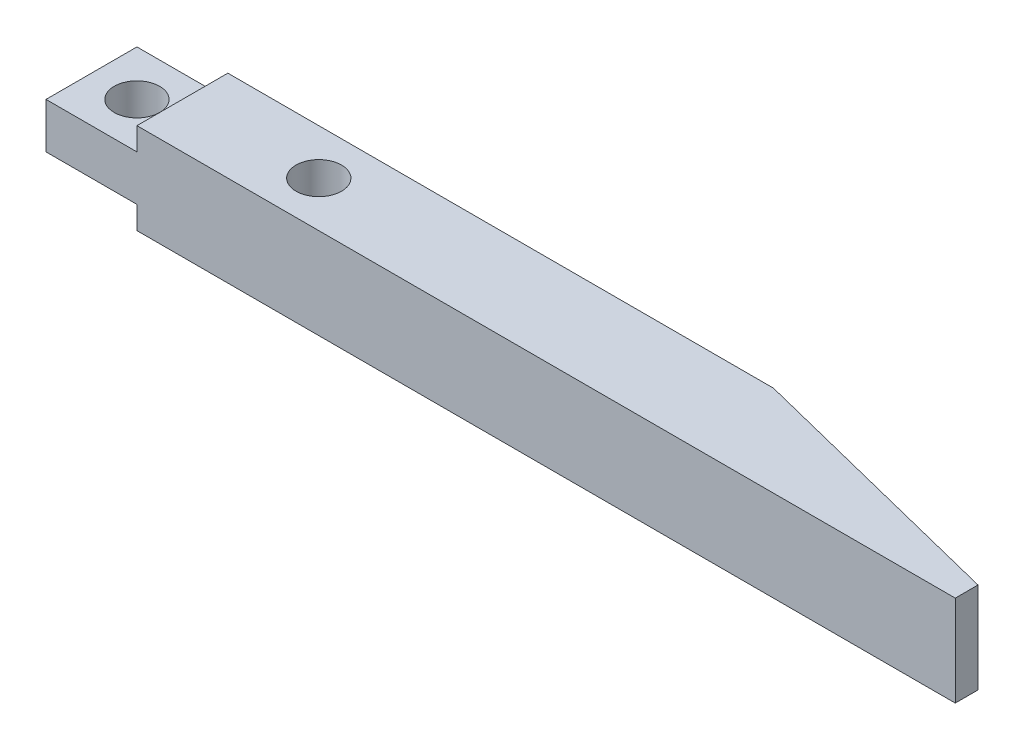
ISO-10303-21;
HEADER;
FILE_DESCRIPTION(('STEP AP214'),'2;1');
FILE_NAME('part.step','',(''),(''),'','','');
FILE_SCHEMA(('AUTOMOTIVE_DESIGN { 1 0 10303 214 1 1 1 1 }'));
ENDSEC;
DATA;
#1=APPLICATION_CONTEXT('core data for automotive mechanical design processes');
#2=APPLICATION_PROTOCOL_DEFINITION('international standard','automotive_design',2000,#1);
#3=PRODUCT_CONTEXT('',#1,'mechanical');
#4=PRODUCT('Part','Part','',(#3));
#5=PRODUCT_RELATED_PRODUCT_CATEGORY('part','',(#4));
#6=PRODUCT_DEFINITION_FORMATION('','',#4);
#7=PRODUCT_DEFINITION_CONTEXT('part definition',#1,'design');
#8=PRODUCT_DEFINITION('design','',#6,#7);
#9=PRODUCT_DEFINITION_SHAPE('','',#8);
#10=(LENGTH_UNIT() NAMED_UNIT(*) SI_UNIT(.MILLI.,.METRE.));
#11=(NAMED_UNIT(*) PLANE_ANGLE_UNIT() SI_UNIT($,.RADIAN.));
#12=(NAMED_UNIT(*) SI_UNIT($,.STERADIAN.) SOLID_ANGLE_UNIT());
#13=UNCERTAINTY_MEASURE_WITH_UNIT(LENGTH_MEASURE(1.E-05),#10,'distance_accuracy_value','');
#14=(GEOMETRIC_REPRESENTATION_CONTEXT(3) GLOBAL_UNCERTAINTY_ASSIGNED_CONTEXT((#13)) GLOBAL_UNIT_ASSIGNED_CONTEXT((#10,
#11,#12)) REPRESENTATION_CONTEXT('',''));
#15=CARTESIAN_POINT('',(0.,0.,0.));
#16=DIRECTION('',(0.,0.,1.));
#17=DIRECTION('',(1.,0.,0.));
#18=AXIS2_PLACEMENT_3D('',#15,#16,#17);
#19=CARTESIAN_POINT('',(0.,12.7,0.));
#20=DIRECTION('',(0.,1.,0.));
#21=DIRECTION('',(0.,0.,1.));
#22=AXIS2_PLACEMENT_3D('',#19,#20,#21);
#23=PLANE('',#22);
#24=DIRECTION('',(0.,0.,1.));
#25=VECTOR('',#24,1.);
#26=CARTESIAN_POINT('',(-19.05,12.7,-6.35));
#27=LINE('',#26,#25);
#28=CARTESIAN_POINT('',(-19.05,12.7,-6.35));
#29=VERTEX_POINT('',#28);
#30=CARTESIAN_POINT('',(-19.05,12.7,6.35));
#31=VERTEX_POINT('',#30);
#32=EDGE_CURVE('E156',#29,#31,#27,.T.);
#33=ORIENTED_EDGE('',*,*,#32,.T.);
#34=DIRECTION('',(1.,0.,0.));
#35=VECTOR('',#34,1.);
#36=CARTESIAN_POINT('',(-31.75,12.7,6.35));
#37=LINE('',#36,#35);
#38=CARTESIAN_POINT('',(95.25,12.7,6.35));
#39=VERTEX_POINT('',#38);
#40=EDGE_CURVE('E135',#31,#39,#37,.T.);
#41=ORIENTED_EDGE('',*,*,#40,.T.);
#42=DIRECTION('',(0.,0.,-1.));
#43=VECTOR('',#42,1.);
#44=CARTESIAN_POINT('',(95.25,12.7,6.35));
#45=LINE('',#44,#43);
#46=CARTESIAN_POINT('',(95.25,12.7,3.175));
#47=VERTEX_POINT('',#46);
#48=EDGE_CURVE('E138',#39,#47,#45,.T.);
#49=ORIENTED_EDGE('',*,*,#48,.T.);
#50=DIRECTION('',(-0.970142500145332,0.,-0.242535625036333));
#51=VECTOR('',#50,1.);
#52=CARTESIAN_POINT('',(95.25,12.7,3.175));
#53=LINE('',#52,#51);
#54=CARTESIAN_POINT('',(57.15,12.7,-6.35));
#55=VERTEX_POINT('',#54);
#56=EDGE_CURVE('E179',#47,#55,#53,.T.);
#57=ORIENTED_EDGE('',*,*,#56,.T.);
#58=DIRECTION('',(-1.,0.,0.));
#59=VECTOR('',#58,1.);
#60=CARTESIAN_POINT('',(57.15,12.7,-6.35));
#61=LINE('',#60,#59);
#62=EDGE_CURVE('E148',#55,#29,#61,.T.);
#63=ORIENTED_EDGE('',*,*,#62,.T.);
#64=EDGE_LOOP('',(#33,#41,#49,#57,#63));
#65=FACE_BOUND('',#64,.T.);
#66=CARTESIAN_POINT('',(0.,12.7,0.));
#67=DIRECTION('',(0.,1.,0.));
#68=DIRECTION('',(0.,0.,1.));
#69=AXIS2_PLACEMENT_3D('',#66,#67,#68);
#70=CIRCLE('',#69,3.175);
#71=CARTESIAN_POINT('',(0.,12.7,3.175));
#72=VERTEX_POINT('',#71);
#73=EDGE_CURVE('E160',#72,#72,#70,.T.);
#74=ORIENTED_EDGE('',*,*,#73,.F.);
#75=EDGE_LOOP('',(#74));
#76=FACE_BOUND('',#75,.T.);
#77=ADVANCED_FACE('F35',(#65,#76),#23,.T.);
#78=CARTESIAN_POINT('',(0.,0.,0.));
#79=DIRECTION('',(0.,1.,0.));
#80=DIRECTION('',(0.,0.,1.));
#81=AXIS2_PLACEMENT_3D('',#78,#79,#80);
#82=PLANE('',#81);
#83=DIRECTION('',(1.,0.,0.));
#84=VECTOR('',#83,1.);
#85=CARTESIAN_POINT('',(-1.01275936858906,0.,6.35));
#86=LINE('',#85,#84);
#87=CARTESIAN_POINT('',(-19.05,0.,6.35));
#88=VERTEX_POINT('',#87);
#89=CARTESIAN_POINT('',(95.25,0.,6.35));
#90=VERTEX_POINT('',#89);
#91=EDGE_CURVE('E128',#88,#90,#86,.T.);
#92=ORIENTED_EDGE('',*,*,#91,.F.);
#93=DIRECTION('',(0.,0.,1.));
#94=VECTOR('',#93,1.);
#95=CARTESIAN_POINT('',(-19.05,0.,-6.35));
#96=LINE('',#95,#94);
#97=CARTESIAN_POINT('',(-19.05,0.,-6.35));
#98=VERTEX_POINT('',#97);
#99=EDGE_CURVE('E111',#98,#88,#96,.T.);
#100=ORIENTED_EDGE('',*,*,#99,.F.);
#101=DIRECTION('',(-1.,0.,0.));
#102=VECTOR('',#101,1.);
#103=CARTESIAN_POINT('',(57.15,0.,-6.35));
#104=LINE('',#103,#102);
#105=CARTESIAN_POINT('',(57.15,0.,-6.35));
#106=VERTEX_POINT('',#105);
#107=EDGE_CURVE('E126',#106,#98,#104,.T.);
#108=ORIENTED_EDGE('',*,*,#107,.F.);
#109=DIRECTION('',(-0.970142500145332,0.,-0.242535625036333));
#110=VECTOR('',#109,1.);
#111=CARTESIAN_POINT('',(95.25,0.,3.175));
#112=LINE('',#111,#110);
#113=CARTESIAN_POINT('',(95.25,0.,3.175));
#114=VERTEX_POINT('',#113);
#115=EDGE_CURVE('E136',#114,#106,#112,.T.);
#116=ORIENTED_EDGE('',*,*,#115,.F.);
#117=DIRECTION('',(0.,0.,-1.));
#118=VECTOR('',#117,1.);
#119=CARTESIAN_POINT('',(95.25,0.,6.35));
#120=LINE('',#119,#118);
#121=EDGE_CURVE('E140',#90,#114,#120,.T.);
#122=ORIENTED_EDGE('',*,*,#121,.F.);
#123=EDGE_LOOP('',(#92,#100,#108,#116,#122));
#124=FACE_BOUND('',#123,.T.);
#125=CARTESIAN_POINT('',(0.,0.,0.));
#126=DIRECTION('',(0.,1.,0.));
#127=DIRECTION('',(0.,0.,1.));
#128=AXIS2_PLACEMENT_3D('',#125,#126,#127);
#129=CIRCLE('',#128,3.175);
#130=CARTESIAN_POINT('',(0.,0.,3.175));
#131=VERTEX_POINT('',#130);
#132=EDGE_CURVE('E155',#131,#131,#129,.T.);
#133=ORIENTED_EDGE('',*,*,#132,.T.);
#134=EDGE_LOOP('',(#133));
#135=FACE_BOUND('',#134,.T.);
#136=ADVANCED_FACE('F123',(#124,#135),#82,.F.);
#137=CARTESIAN_POINT('',(-1.01275936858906,12.7,6.35));
#138=DIRECTION('',(0.,0.,-1.));
#139=DIRECTION('',(-1.,0.,0.));
#140=AXIS2_PLACEMENT_3D('',#137,#138,#139);
#141=PLANE('',#140);
#142=DIRECTION('',(0.,-1.,0.));
#143=VECTOR('',#142,1.);
#144=CARTESIAN_POINT('',(-31.75,12.7,6.35));
#145=LINE('',#144,#143);
#146=CARTESIAN_POINT('',(-31.75,9.525,6.35));
#147=VERTEX_POINT('',#146);
#148=CARTESIAN_POINT('',(-31.75,3.175,6.35));
#149=VERTEX_POINT('',#148);
#150=EDGE_CURVE('E144',#147,#149,#145,.T.);
#151=ORIENTED_EDGE('',*,*,#150,.T.);
#152=DIRECTION('',(-1.,0.,0.));
#153=VECTOR('',#152,1.);
#154=CARTESIAN_POINT('',(-31.75,3.175,6.35));
#155=LINE('',#154,#153);
#156=CARTESIAN_POINT('',(-19.05,3.175,6.35));
#157=VERTEX_POINT('',#156);
#158=EDGE_CURVE('E52',#157,#149,#155,.T.);
#159=ORIENTED_EDGE('',*,*,#158,.F.);
#160=DIRECTION('',(0.,1.,0.));
#161=VECTOR('',#160,1.);
#162=CARTESIAN_POINT('',(-19.05,0.,6.35));
#163=LINE('',#162,#161);
#164=EDGE_CURVE('E193',#88,#157,#163,.T.);
#165=ORIENTED_EDGE('',*,*,#164,.F.);
#166=ORIENTED_EDGE('',*,*,#91,.T.);
#167=DIRECTION('',(0.,-1.,0.));
#168=VECTOR('',#167,1.);
#169=CARTESIAN_POINT('',(95.25,12.7,6.35));
#170=LINE('',#169,#168);
#171=EDGE_CURVE('E11',#39,#90,#170,.T.);
#172=ORIENTED_EDGE('',*,*,#171,.F.);
#173=ORIENTED_EDGE('',*,*,#40,.F.);
#174=DIRECTION('',(0.,1.,0.));
#175=VECTOR('',#174,1.);
#176=CARTESIAN_POINT('',(-19.05,12.7,6.35));
#177=LINE('',#176,#175);
#178=CARTESIAN_POINT('',(-19.05,9.525,6.35));
#179=VERTEX_POINT('',#178);
#180=EDGE_CURVE('E171',#179,#31,#177,.T.);
#181=ORIENTED_EDGE('',*,*,#180,.F.);
#182=DIRECTION('',(1.,0.,0.));
#183=VECTOR('',#182,1.);
#184=CARTESIAN_POINT('',(-31.75,9.525,6.35));
#185=LINE('',#184,#183);
#186=EDGE_CURVE('E203',#147,#179,#185,.T.);
#187=ORIENTED_EDGE('',*,*,#186,.F.);
#188=EDGE_LOOP('',(#151,#159,#165,#166,#172,#173,#181,#187));
#189=FACE_BOUND('',#188,.T.);
#190=ADVANCED_FACE('F37',(#189),#141,.F.);
#191=CARTESIAN_POINT('',(95.25,12.7,6.35));
#192=DIRECTION('',(-1.,0.,0.));
#193=DIRECTION('',(0.,0.,1.));
#194=AXIS2_PLACEMENT_3D('',#191,#192,#193);
#195=PLANE('',#194);
#196=ORIENTED_EDGE('',*,*,#121,.T.);
#197=DIRECTION('',(0.,-1.,0.));
#198=VECTOR('',#197,1.);
#199=CARTESIAN_POINT('',(95.25,12.7,3.175));
#200=LINE('',#199,#198);
#201=EDGE_CURVE('E44',#47,#114,#200,.T.);
#202=ORIENTED_EDGE('',*,*,#201,.F.);
#203=ORIENTED_EDGE('',*,*,#48,.F.);
#204=ORIENTED_EDGE('',*,*,#171,.T.);
#205=EDGE_LOOP('',(#196,#202,#203,#204));
#206=FACE_BOUND('',#205,.T.);
#207=ADVANCED_FACE('F184',(#206),#195,.F.);
#208=CARTESIAN_POINT('',(95.25,12.7,3.175));
#209=DIRECTION('',(-0.242535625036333,0.,0.970142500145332));
#210=DIRECTION('',(0.970142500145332,0.,0.242535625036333));
#211=AXIS2_PLACEMENT_3D('',#208,#209,#210);
#212=PLANE('',#211);
#213=ORIENTED_EDGE('',*,*,#115,.T.);
#214=DIRECTION('',(0.,-1.,0.));
#215=VECTOR('',#214,1.);
#216=CARTESIAN_POINT('',(57.15,12.7,-6.35));
#217=LINE('',#216,#215);
#218=EDGE_CURVE('E134',#55,#106,#217,.T.);
#219=ORIENTED_EDGE('',*,*,#218,.F.);
#220=ORIENTED_EDGE('',*,*,#56,.F.);
#221=ORIENTED_EDGE('',*,*,#201,.T.);
#222=EDGE_LOOP('',(#213,#219,#220,#221));
#223=FACE_BOUND('',#222,.T.);
#224=ADVANCED_FACE('F189',(#223),#212,.F.);
#225=CARTESIAN_POINT('',(57.15,12.7,-6.35));
#226=DIRECTION('',(0.,0.,1.));
#227=DIRECTION('',(1.,0.,0.));
#228=AXIS2_PLACEMENT_3D('',#225,#226,#227);
#229=PLANE('',#228);
#230=DIRECTION('',(0.,1.,0.));
#231=VECTOR('',#230,1.);
#232=CARTESIAN_POINT('',(-19.05,0.,-6.35));
#233=LINE('',#232,#231);
#234=CARTESIAN_POINT('',(-19.05,3.175,-6.35));
#235=VERTEX_POINT('',#234);
#236=EDGE_CURVE('E107',#98,#235,#233,.T.);
#237=ORIENTED_EDGE('',*,*,#236,.T.);
#238=DIRECTION('',(-1.,0.,0.));
#239=VECTOR('',#238,1.);
#240=CARTESIAN_POINT('',(-31.75,3.175,-6.35));
#241=LINE('',#240,#239);
#242=CARTESIAN_POINT('',(-31.75,3.175,-6.35));
#243=VERTEX_POINT('',#242);
#244=EDGE_CURVE('E118',#235,#243,#241,.T.);
#245=ORIENTED_EDGE('',*,*,#244,.T.);
#246=DIRECTION('',(0.,-1.,0.));
#247=VECTOR('',#246,1.);
#248=CARTESIAN_POINT('',(-31.75,12.7,-6.35));
#249=LINE('',#248,#247);
#250=CARTESIAN_POINT('',(-31.75,9.525,-6.35));
#251=VERTEX_POINT('',#250);
#252=EDGE_CURVE('E147',#251,#243,#249,.T.);
#253=ORIENTED_EDGE('',*,*,#252,.F.);
#254=DIRECTION('',(1.,0.,0.));
#255=VECTOR('',#254,1.);
#256=CARTESIAN_POINT('',(-31.75,9.525,-6.35));
#257=LINE('',#256,#255);
#258=CARTESIAN_POINT('',(-19.05,9.525,-6.35));
#259=VERTEX_POINT('',#258);
#260=EDGE_CURVE('E60',#251,#259,#257,.T.);
#261=ORIENTED_EDGE('',*,*,#260,.T.);
#262=DIRECTION('',(0.,1.,0.));
#263=VECTOR('',#262,1.);
#264=CARTESIAN_POINT('',(-19.05,12.7,-6.35));
#265=LINE('',#264,#263);
#266=EDGE_CURVE('E175',#259,#29,#265,.T.);
#267=ORIENTED_EDGE('',*,*,#266,.T.);
#268=ORIENTED_EDGE('',*,*,#62,.F.);
#269=ORIENTED_EDGE('',*,*,#218,.T.);
#270=ORIENTED_EDGE('',*,*,#107,.T.);
#271=EDGE_LOOP('',(#237,#245,#253,#261,#267,#268,#269,#270));
#272=FACE_BOUND('',#271,.T.);
#273=ADVANCED_FACE('F131',(#272),#229,.F.);
#274=CARTESIAN_POINT('',(-31.75,12.7,-6.35));
#275=DIRECTION('',(1.,0.,0.));
#276=DIRECTION('',(0.,0.,-1.));
#277=AXIS2_PLACEMENT_3D('',#274,#275,#276);
#278=PLANE('',#277);
#279=ORIENTED_EDGE('',*,*,#252,.T.);
#280=DIRECTION('',(0.,0.,1.));
#281=VECTOR('',#280,1.);
#282=CARTESIAN_POINT('',(-31.75,3.175,-6.35));
#283=LINE('',#282,#281);
#284=EDGE_CURVE('E198',#243,#149,#283,.T.);
#285=ORIENTED_EDGE('',*,*,#284,.T.);
#286=ORIENTED_EDGE('',*,*,#150,.F.);
#287=DIRECTION('',(0.,0.,1.));
#288=VECTOR('',#287,1.);
#289=CARTESIAN_POINT('',(-31.75,9.525,-6.35));
#290=LINE('',#289,#288);
#291=EDGE_CURVE('E168',#251,#147,#290,.T.);
#292=ORIENTED_EDGE('',*,*,#291,.F.);
#293=EDGE_LOOP('',(#279,#285,#286,#292));
#294=FACE_BOUND('',#293,.T.);
#295=ADVANCED_FACE('F224',(#294),#278,.F.);
#296=CARTESIAN_POINT('',(0.,12.7,0.));
#297=DIRECTION('',(0.,-1.,0.));
#298=DIRECTION('',(0.,0.,-1.));
#299=AXIS2_PLACEMENT_3D('',#296,#297,#298);
#300=CYLINDRICAL_SURFACE('',#299,3.175);
#301=ORIENTED_EDGE('',*,*,#73,.T.);
#302=EDGE_LOOP('',(#301));
#303=FACE_BOUND('',#302,.T.);
#304=ORIENTED_EDGE('',*,*,#132,.F.);
#305=EDGE_LOOP('',(#304));
#306=FACE_BOUND('',#305,.T.);
#307=ADVANCED_FACE('F215',(#303,#306),#300,.F.);
#308=CARTESIAN_POINT('',(-25.4,12.7,0.));
#309=DIRECTION('',(0.,-1.,0.));
#310=DIRECTION('',(0.,0.,-1.));
#311=AXIS2_PLACEMENT_3D('',#308,#309,#310);
#312=CYLINDRICAL_SURFACE('',#311,3.175);
#313=CARTESIAN_POINT('',(-25.4,3.175,0.));
#314=DIRECTION('',(0.,1.,0.));
#315=DIRECTION('',(0.,0.,1.));
#316=AXIS2_PLACEMENT_3D('',#313,#314,#315);
#317=CIRCLE('',#316,3.175);
#318=CARTESIAN_POINT('',(-25.4,3.175,3.175));
#319=VERTEX_POINT('',#318);
#320=EDGE_CURVE('E39',#319,#319,#317,.T.);
#321=ORIENTED_EDGE('',*,*,#320,.F.);
#322=EDGE_LOOP('',(#321));
#323=FACE_BOUND('',#322,.T.);
#324=CARTESIAN_POINT('',(-25.4,9.525,0.));
#325=DIRECTION('',(0.,-1.,0.));
#326=DIRECTION('',(0.,0.,-1.));
#327=AXIS2_PLACEMENT_3D('',#324,#325,#326);
#328=CIRCLE('',#327,3.175);
#329=CARTESIAN_POINT('',(-25.4,9.525,-3.175));
#330=VERTEX_POINT('',#329);
#331=EDGE_CURVE('E153',#330,#330,#328,.T.);
#332=ORIENTED_EDGE('',*,*,#331,.F.);
#333=EDGE_LOOP('',(#332));
#334=FACE_BOUND('',#333,.T.);
#335=ADVANCED_FACE('F211',(#323,#334),#312,.F.);
#336=CARTESIAN_POINT('',(-19.05,12.7,-6.35));
#337=DIRECTION('',(1.,0.,0.));
#338=DIRECTION('',(0.,0.,-1.));
#339=AXIS2_PLACEMENT_3D('',#336,#337,#338);
#340=PLANE('',#339);
#341=ORIENTED_EDGE('',*,*,#180,.T.);
#342=ORIENTED_EDGE('',*,*,#32,.F.);
#343=ORIENTED_EDGE('',*,*,#266,.F.);
#344=DIRECTION('',(0.,0.,1.));
#345=VECTOR('',#344,1.);
#346=CARTESIAN_POINT('',(-19.05,9.525,-6.35));
#347=LINE('',#346,#345);
#348=EDGE_CURVE('E163',#259,#179,#347,.T.);
#349=ORIENTED_EDGE('',*,*,#348,.T.);
#350=EDGE_LOOP('',(#341,#342,#343,#349));
#351=FACE_BOUND('',#350,.T.);
#352=ADVANCED_FACE('F214',(#351),#340,.F.);
#353=CARTESIAN_POINT('',(-31.75,9.525,-6.35));
#354=DIRECTION('',(0.,-1.,0.));
#355=DIRECTION('',(0.,0.,-1.));
#356=AXIS2_PLACEMENT_3D('',#353,#354,#355);
#357=PLANE('',#356);
#358=ORIENTED_EDGE('',*,*,#331,.T.);
#359=EDGE_LOOP('',(#358));
#360=FACE_BOUND('',#359,.T.);
#361=ORIENTED_EDGE('',*,*,#186,.T.);
#362=ORIENTED_EDGE('',*,*,#348,.F.);
#363=ORIENTED_EDGE('',*,*,#260,.F.);
#364=ORIENTED_EDGE('',*,*,#291,.T.);
#365=EDGE_LOOP('',(#361,#362,#363,#364));
#366=FACE_BOUND('',#365,.T.);
#367=ADVANCED_FACE('F221',(#360,#366),#357,.F.);
#368=CARTESIAN_POINT('',(-31.75,3.175,-6.35));
#369=DIRECTION('',(0.,1.,0.));
#370=DIRECTION('',(0.,0.,1.));
#371=AXIS2_PLACEMENT_3D('',#368,#369,#370);
#372=PLANE('',#371);
#373=ORIENTED_EDGE('',*,*,#320,.T.);
#374=EDGE_LOOP('',(#373));
#375=FACE_BOUND('',#374,.T.);
#376=ORIENTED_EDGE('',*,*,#158,.T.);
#377=ORIENTED_EDGE('',*,*,#284,.F.);
#378=ORIENTED_EDGE('',*,*,#244,.F.);
#379=DIRECTION('',(0.,0.,1.));
#380=VECTOR('',#379,1.);
#381=CARTESIAN_POINT('',(-19.05,3.175,-6.35));
#382=LINE('',#381,#380);
#383=EDGE_CURVE('E113',#235,#157,#382,.T.);
#384=ORIENTED_EDGE('',*,*,#383,.T.);
#385=EDGE_LOOP('',(#376,#377,#378,#384));
#386=FACE_BOUND('',#385,.T.);
#387=ADVANCED_FACE('F209',(#375,#386),#372,.F.);
#388=CARTESIAN_POINT('',(-19.05,0.,-6.35));
#389=DIRECTION('',(1.,0.,0.));
#390=DIRECTION('',(0.,0.,-1.));
#391=AXIS2_PLACEMENT_3D('',#388,#389,#390);
#392=PLANE('',#391);
#393=ORIENTED_EDGE('',*,*,#164,.T.);
#394=ORIENTED_EDGE('',*,*,#383,.F.);
#395=ORIENTED_EDGE('',*,*,#236,.F.);
#396=ORIENTED_EDGE('',*,*,#99,.T.);
#397=EDGE_LOOP('',(#393,#394,#395,#396));
#398=FACE_BOUND('',#397,.T.);
#399=ADVANCED_FACE('F110',(#398),#392,.F.);
#400=CLOSED_SHELL('',(#77,#136,#190,#207,#224,#273,#295,#307,#335,#352,#367,#387,#399));
#401=MANIFOLD_SOLID_BREP('B2',#400);
#402=ADVANCED_BREP_SHAPE_REPRESENTATION('',(#18,#401),#14);
#403=SHAPE_DEFINITION_REPRESENTATION(#9,#402);
ENDSEC;
END-ISO-10303-21;
